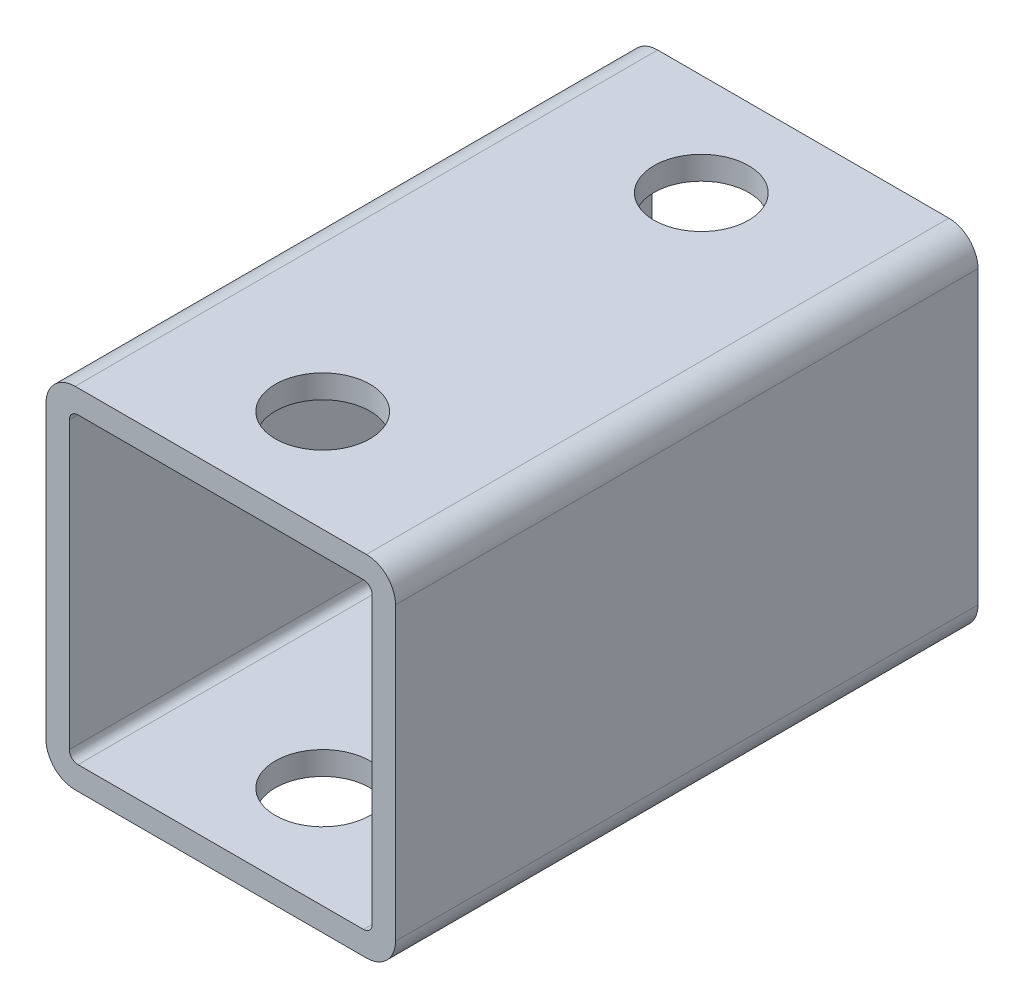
ISO-10303-21;
HEADER;
FILE_DESCRIPTION(('STEP AP214'),'2;1');
FILE_NAME('part.step','',(''),(''),'','','');
FILE_SCHEMA(('AUTOMOTIVE_DESIGN { 1 0 10303 214 1 1 1 1 }'));
ENDSEC;
DATA;
#1=APPLICATION_CONTEXT('core data for automotive mechanical design processes');
#2=APPLICATION_PROTOCOL_DEFINITION('international standard','automotive_design',2000,#1);
#3=PRODUCT_CONTEXT('',#1,'mechanical');
#4=PRODUCT('Part','Part','',(#3));
#5=PRODUCT_RELATED_PRODUCT_CATEGORY('part','',(#4));
#6=PRODUCT_DEFINITION_FORMATION('','',#4);
#7=PRODUCT_DEFINITION_CONTEXT('part definition',#1,'design');
#8=PRODUCT_DEFINITION('design','',#6,#7);
#9=PRODUCT_DEFINITION_SHAPE('','',#8);
#10=(LENGTH_UNIT() NAMED_UNIT(*) SI_UNIT(.MILLI.,.METRE.));
#11=(NAMED_UNIT(*) PLANE_ANGLE_UNIT() SI_UNIT($,.RADIAN.));
#12=(NAMED_UNIT(*) SI_UNIT($,.STERADIAN.) SOLID_ANGLE_UNIT());
#13=UNCERTAINTY_MEASURE_WITH_UNIT(LENGTH_MEASURE(1.E-05),#10,'distance_accuracy_value','');
#14=(GEOMETRIC_REPRESENTATION_CONTEXT(3) GLOBAL_UNCERTAINTY_ASSIGNED_CONTEXT((#13)) GLOBAL_UNIT_ASSIGNED_CONTEXT((#10,
#11,#12)) REPRESENTATION_CONTEXT('',''));
#15=CARTESIAN_POINT('',(0.,0.,0.));
#16=DIRECTION('',(0.,0.,1.));
#17=DIRECTION('',(1.,0.,0.));
#18=AXIS2_PLACEMENT_3D('',#15,#16,#17);
#19=CARTESIAN_POINT('',(-12.5,5.,51.));
#20=DIRECTION('',(0.,0.,-1.));
#21=DIRECTION('',(-1.,0.,0.));
#22=AXIS2_PLACEMENT_3D('',#19,#20,#21);
#23=CYLINDRICAL_SURFACE('',#22,0.999999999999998);
#24=CARTESIAN_POINT('',(-12.5,5.,51.));
#25=DIRECTION('',(0.,0.,-1.));
#26=DIRECTION('',(-1.,0.,0.));
#27=AXIS2_PLACEMENT_3D('',#24,#25,#26);
#28=CIRCLE('',#27,0.999999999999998);
#29=CARTESIAN_POINT('',(-13.5,5.,51.));
#30=VERTEX_POINT('',#29);
#31=CARTESIAN_POINT('',(-12.5,6.,51.));
#32=VERTEX_POINT('',#31);
#33=EDGE_CURVE('E95',#30,#32,#28,.T.);
#34=ORIENTED_EDGE('',*,*,#33,.T.);
#35=DIRECTION('',(0.,0.,1.));
#36=VECTOR('',#35,1.);
#37=CARTESIAN_POINT('',(-12.5,6.,41.));
#38=LINE('',#37,#36);
#39=CARTESIAN_POINT('',(-12.5,6.,31.));
#40=VERTEX_POINT('',#39);
#41=EDGE_CURVE('E92',#32,#40,#38,.F.);
#42=ORIENTED_EDGE('',*,*,#41,.T.);
#43=CARTESIAN_POINT('',(-12.5,5.,31.));
#44=DIRECTION('',(0.,0.,-1.));
#45=DIRECTION('',(-1.,0.,0.));
#46=AXIS2_PLACEMENT_3D('',#43,#44,#45);
#47=CIRCLE('',#46,0.999999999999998);
#48=CARTESIAN_POINT('',(-13.5,5.,31.));
#49=VERTEX_POINT('',#48);
#50=EDGE_CURVE('E21',#49,#40,#47,.T.);
#51=ORIENTED_EDGE('',*,*,#50,.F.);
#52=DIRECTION('',(0.,0.,-1.));
#53=VECTOR('',#52,1.);
#54=CARTESIAN_POINT('',(-13.5,5.,41.));
#55=LINE('',#54,#53);
#56=EDGE_CURVE('E159',#49,#30,#55,.F.);
#57=ORIENTED_EDGE('',*,*,#56,.T.);
#58=EDGE_LOOP('',(#34,#42,#51,#57));
#59=FACE_BOUND('',#58,.T.);
#60=ADVANCED_FACE('F17',(#59),#23,.T.);
#61=CARTESIAN_POINT('',(-12.5,-5.,51.));
#62=DIRECTION('',(0.,0.,-1.));
#63=DIRECTION('',(-1.,0.,0.));
#64=AXIS2_PLACEMENT_3D('',#61,#62,#63);
#65=CYLINDRICAL_SURFACE('',#64,1.);
#66=CARTESIAN_POINT('',(-12.5,-5.,51.));
#67=DIRECTION('',(0.,0.,-1.));
#68=DIRECTION('',(-1.,0.,0.));
#69=AXIS2_PLACEMENT_3D('',#66,#67,#68);
#70=CIRCLE('',#69,1.);
#71=CARTESIAN_POINT('',(-12.5,-6.,51.));
#72=VERTEX_POINT('',#71);
#73=CARTESIAN_POINT('',(-13.5,-5.,51.));
#74=VERTEX_POINT('',#73);
#75=EDGE_CURVE('E210',#72,#74,#70,.T.);
#76=ORIENTED_EDGE('',*,*,#75,.T.);
#77=DIRECTION('',(0.,0.,1.));
#78=VECTOR('',#77,1.);
#79=CARTESIAN_POINT('',(-13.5,-5.,41.));
#80=LINE('',#79,#78);
#81=CARTESIAN_POINT('',(-13.5,-5.,31.));
#82=VERTEX_POINT('',#81);
#83=EDGE_CURVE('E158',#74,#82,#80,.F.);
#84=ORIENTED_EDGE('',*,*,#83,.T.);
#85=CARTESIAN_POINT('',(-12.5,-5.,31.));
#86=DIRECTION('',(0.,0.,-1.));
#87=DIRECTION('',(-1.,0.,0.));
#88=AXIS2_PLACEMENT_3D('',#85,#86,#87);
#89=CIRCLE('',#88,1.);
#90=CARTESIAN_POINT('',(-12.5,-6.,31.));
#91=VERTEX_POINT('',#90);
#92=EDGE_CURVE('E89',#91,#82,#89,.T.);
#93=ORIENTED_EDGE('',*,*,#92,.F.);
#94=DIRECTION('',(0.,0.,-1.));
#95=VECTOR('',#94,1.);
#96=CARTESIAN_POINT('',(-12.5,-6.,41.));
#97=LINE('',#96,#95);
#98=EDGE_CURVE('E151',#91,#72,#97,.F.);
#99=ORIENTED_EDGE('',*,*,#98,.T.);
#100=EDGE_LOOP('',(#76,#84,#93,#99));
#101=FACE_BOUND('',#100,.T.);
#102=ADVANCED_FACE('F235',(#101),#65,.T.);
#103=CARTESIAN_POINT('',(-2.5,5.,51.));
#104=DIRECTION('',(0.,0.,-1.));
#105=DIRECTION('',(-1.,0.,0.));
#106=AXIS2_PLACEMENT_3D('',#103,#104,#105);
#107=CYLINDRICAL_SURFACE('',#106,1.);
#108=CARTESIAN_POINT('',(-2.5,5.,51.));
#109=DIRECTION('',(0.,0.,-1.));
#110=DIRECTION('',(-1.,0.,0.));
#111=AXIS2_PLACEMENT_3D('',#108,#109,#110);
#112=CIRCLE('',#111,1.);
#113=CARTESIAN_POINT('',(-2.5,6.,51.));
#114=VERTEX_POINT('',#113);
#115=CARTESIAN_POINT('',(-1.5,5.,51.));
#116=VERTEX_POINT('',#115);
#117=EDGE_CURVE('E216',#114,#116,#112,.T.);
#118=ORIENTED_EDGE('',*,*,#117,.T.);
#119=DIRECTION('',(0.,0.,1.));
#120=VECTOR('',#119,1.);
#121=CARTESIAN_POINT('',(-1.5,5.,41.));
#122=LINE('',#121,#120);
#123=CARTESIAN_POINT('',(-1.5,5.,31.));
#124=VERTEX_POINT('',#123);
#125=EDGE_CURVE('E147',#116,#124,#122,.F.);
#126=ORIENTED_EDGE('',*,*,#125,.T.);
#127=CARTESIAN_POINT('',(-2.5,5.,31.));
#128=DIRECTION('',(0.,0.,-1.));
#129=DIRECTION('',(-1.,0.,0.));
#130=AXIS2_PLACEMENT_3D('',#127,#128,#129);
#131=CIRCLE('',#130,1.);
#132=CARTESIAN_POINT('',(-2.5,6.,31.));
#133=VERTEX_POINT('',#132);
#134=EDGE_CURVE('E229',#133,#124,#131,.T.);
#135=ORIENTED_EDGE('',*,*,#134,.F.);
#136=DIRECTION('',(0.,0.,-1.));
#137=VECTOR('',#136,1.);
#138=CARTESIAN_POINT('',(-2.5,6.,41.));
#139=LINE('',#138,#137);
#140=EDGE_CURVE('E105',#133,#114,#139,.F.);
#141=ORIENTED_EDGE('',*,*,#140,.T.);
#142=EDGE_LOOP('',(#118,#126,#135,#141));
#143=FACE_BOUND('',#142,.T.);
#144=ADVANCED_FACE('F297',(#143),#107,.T.);
#145=CARTESIAN_POINT('',(-2.5,-5.,51.));
#146=DIRECTION('',(0.,0.,-1.));
#147=DIRECTION('',(-1.,0.,0.));
#148=AXIS2_PLACEMENT_3D('',#145,#146,#147);
#149=CYLINDRICAL_SURFACE('',#148,1.);
#150=CARTESIAN_POINT('',(-2.5,-5.,51.));
#151=DIRECTION('',(0.,0.,-1.));
#152=DIRECTION('',(-1.,0.,0.));
#153=AXIS2_PLACEMENT_3D('',#150,#151,#152);
#154=CIRCLE('',#153,1.);
#155=CARTESIAN_POINT('',(-1.5,-5.,51.));
#156=VERTEX_POINT('',#155);
#157=CARTESIAN_POINT('',(-2.5,-6.,51.));
#158=VERTEX_POINT('',#157);
#159=EDGE_CURVE('E213',#156,#158,#154,.T.);
#160=ORIENTED_EDGE('',*,*,#159,.T.);
#161=DIRECTION('',(0.,0.,1.));
#162=VECTOR('',#161,1.);
#163=CARTESIAN_POINT('',(-2.5,-6.,41.));
#164=LINE('',#163,#162);
#165=CARTESIAN_POINT('',(-2.5,-6.,31.));
#166=VERTEX_POINT('',#165);
#167=EDGE_CURVE('E155',#158,#166,#164,.F.);
#168=ORIENTED_EDGE('',*,*,#167,.T.);
#169=CARTESIAN_POINT('',(-2.5,-5.,31.));
#170=DIRECTION('',(0.,0.,-1.));
#171=DIRECTION('',(-1.,0.,0.));
#172=AXIS2_PLACEMENT_3D('',#169,#170,#171);
#173=CIRCLE('',#172,1.);
#174=CARTESIAN_POINT('',(-1.5,-5.,31.));
#175=VERTEX_POINT('',#174);
#176=EDGE_CURVE('E227',#175,#166,#173,.T.);
#177=ORIENTED_EDGE('',*,*,#176,.F.);
#178=DIRECTION('',(0.,0.,-1.));
#179=VECTOR('',#178,1.);
#180=CARTESIAN_POINT('',(-1.5,-5.,41.));
#181=LINE('',#180,#179);
#182=EDGE_CURVE('E144',#175,#156,#181,.F.);
#183=ORIENTED_EDGE('',*,*,#182,.T.);
#184=EDGE_LOOP('',(#160,#168,#177,#183));
#185=FACE_BOUND('',#184,.T.);
#186=ADVANCED_FACE('F295',(#185),#149,.T.);
#187=CARTESIAN_POINT('',(-2.6,-4.9,31.));
#188=DIRECTION('',(0.,0.,1.));
#189=DIRECTION('',(1.,0.,0.));
#190=AXIS2_PLACEMENT_3D('',#187,#188,#189);
#191=CYLINDRICAL_SURFACE('',#190,0.3);
#192=DIRECTION('',(0.,0.,1.));
#193=VECTOR('',#192,1.);
#194=CARTESIAN_POINT('',(-2.3,-4.9,41.));
#195=LINE('',#194,#193);
#196=CARTESIAN_POINT('',(-2.3,-4.9,51.));
#197=VERTEX_POINT('',#196);
#198=CARTESIAN_POINT('',(-2.3,-4.9,31.));
#199=VERTEX_POINT('',#198);
#200=EDGE_CURVE('E140',#197,#199,#195,.F.);
#201=ORIENTED_EDGE('',*,*,#200,.T.);
#202=CARTESIAN_POINT('',(-2.6,-4.9,31.));
#203=DIRECTION('',(0.,0.,1.));
#204=DIRECTION('',(1.,0.,0.));
#205=AXIS2_PLACEMENT_3D('',#202,#203,#204);
#206=CIRCLE('',#205,0.3);
#207=CARTESIAN_POINT('',(-2.6,-5.2,31.));
#208=VERTEX_POINT('',#207);
#209=EDGE_CURVE('E225',#208,#199,#206,.T.);
#210=ORIENTED_EDGE('',*,*,#209,.F.);
#211=DIRECTION('',(0.,0.,-1.));
#212=VECTOR('',#211,1.);
#213=CARTESIAN_POINT('',(-2.6,-5.2,41.));
#214=LINE('',#213,#212);
#215=CARTESIAN_POINT('',(-2.59999999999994,-5.2,51.));
#216=VERTEX_POINT('',#215);
#217=EDGE_CURVE('E129',#208,#216,#214,.F.);
#218=ORIENTED_EDGE('',*,*,#217,.T.);
#219=CARTESIAN_POINT('',(-2.59999999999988,-4.9,51.));
#220=DIRECTION('',(0.,0.,1.));
#221=DIRECTION('',(1.,0.,0.));
#222=AXIS2_PLACEMENT_3D('',#219,#220,#221);
#223=CIRCLE('',#222,0.3);
#224=EDGE_CURVE('E206',#216,#197,#223,.T.);
#225=ORIENTED_EDGE('',*,*,#224,.T.);
#226=EDGE_LOOP('',(#201,#210,#218,#225));
#227=FACE_BOUND('',#226,.T.);
#228=ADVANCED_FACE('F305',(#227),#191,.F.);
#229=CARTESIAN_POINT('',(-7.5,-6.,34.5));
#230=DIRECTION('',(0.,1.,0.));
#231=DIRECTION('',(0.,0.,1.));
#232=AXIS2_PLACEMENT_3D('',#229,#230,#231);
#233=CYLINDRICAL_SURFACE('',#232,1.62499999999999);
#234=CARTESIAN_POINT('',(-7.5,-6.,34.5));
#235=DIRECTION('',(0.,1.,0.));
#236=DIRECTION('',(0.,0.,1.));
#237=AXIS2_PLACEMENT_3D('',#234,#235,#236);
#238=CIRCLE('',#237,1.62499999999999);
#239=CARTESIAN_POINT('',(-7.5,-6.,36.125));
#240=VERTEX_POINT('',#239);
#241=EDGE_CURVE('E180',#240,#240,#238,.F.);
#242=ORIENTED_EDGE('',*,*,#241,.T.);
#243=EDGE_LOOP('',(#242));
#244=FACE_BOUND('',#243,.T.);
#245=CARTESIAN_POINT('',(-7.5,-5.2,34.5));
#246=DIRECTION('',(0.,1.,0.));
#247=DIRECTION('',(0.,0.,1.));
#248=AXIS2_PLACEMENT_3D('',#245,#246,#247);
#249=CIRCLE('',#248,1.62499999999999);
#250=CARTESIAN_POINT('',(-7.5,-5.2,36.125));
#251=VERTEX_POINT('',#250);
#252=EDGE_CURVE('E173',#251,#251,#249,.T.);
#253=ORIENTED_EDGE('',*,*,#252,.T.);
#254=EDGE_LOOP('',(#253));
#255=FACE_BOUND('',#254,.T.);
#256=ADVANCED_FACE('F375',(#244,#255),#233,.F.);
#257=CARTESIAN_POINT('',(-7.5,-6.,47.5));
#258=DIRECTION('',(0.,1.,0.));
#259=DIRECTION('',(0.,0.,1.));
#260=AXIS2_PLACEMENT_3D('',#257,#258,#259);
#261=CYLINDRICAL_SURFACE('',#260,1.625);
#262=CARTESIAN_POINT('',(-7.5,-6.,47.5));
#263=DIRECTION('',(0.,1.,0.));
#264=DIRECTION('',(0.,0.,1.));
#265=AXIS2_PLACEMENT_3D('',#262,#263,#264);
#266=CIRCLE('',#265,1.625);
#267=CARTESIAN_POINT('',(-7.5,-6.,49.125));
#268=VERTEX_POINT('',#267);
#269=EDGE_CURVE('E150',#268,#268,#266,.F.);
#270=ORIENTED_EDGE('',*,*,#269,.T.);
#271=EDGE_LOOP('',(#270));
#272=FACE_BOUND('',#271,.T.);
#273=CARTESIAN_POINT('',(-7.5,-5.2,47.5));
#274=DIRECTION('',(0.,1.,0.));
#275=DIRECTION('',(0.,0.,1.));
#276=AXIS2_PLACEMENT_3D('',#273,#274,#275);
#277=CIRCLE('',#276,1.625);
#278=CARTESIAN_POINT('',(-7.5,-5.2,49.125));
#279=VERTEX_POINT('',#278);
#280=EDGE_CURVE('E126',#279,#279,#277,.T.);
#281=ORIENTED_EDGE('',*,*,#280,.T.);
#282=EDGE_LOOP('',(#281));
#283=FACE_BOUND('',#282,.T.);
#284=ADVANCED_FACE('F385',(#272,#283),#261,.F.);
#285=CARTESIAN_POINT('',(-12.4,-4.9,31.));
#286=DIRECTION('',(0.,0.,1.));
#287=DIRECTION('',(0.,-1.,0.));
#288=AXIS2_PLACEMENT_3D('',#285,#286,#287);
#289=CYLINDRICAL_SURFACE('',#288,0.299999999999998);
#290=DIRECTION('',(0.,0.,1.));
#291=VECTOR('',#290,1.);
#292=CARTESIAN_POINT('',(-12.4,-5.2,41.));
#293=LINE('',#292,#291);
#294=CARTESIAN_POINT('',(-12.4,-5.2,51.));
#295=VERTEX_POINT('',#294);
#296=CARTESIAN_POINT('',(-12.4,-5.2,31.));
#297=VERTEX_POINT('',#296);
#298=EDGE_CURVE('E133',#295,#297,#293,.F.);
#299=ORIENTED_EDGE('',*,*,#298,.T.);
#300=CARTESIAN_POINT('',(-12.4,-4.9,31.));
#301=DIRECTION('',(0.,0.,1.));
#302=DIRECTION('',(0.,-1.,0.));
#303=AXIS2_PLACEMENT_3D('',#300,#301,#302);
#304=CIRCLE('',#303,0.299999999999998);
#305=CARTESIAN_POINT('',(-12.7,-4.9,31.));
#306=VERTEX_POINT('',#305);
#307=EDGE_CURVE('E223',#306,#297,#304,.T.);
#308=ORIENTED_EDGE('',*,*,#307,.F.);
#309=DIRECTION('',(0.,0.,-1.));
#310=VECTOR('',#309,1.);
#311=CARTESIAN_POINT('',(-12.7,-4.9,41.));
#312=LINE('',#311,#310);
#313=CARTESIAN_POINT('',(-12.7,-4.90000000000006,51.));
#314=VERTEX_POINT('',#313);
#315=EDGE_CURVE('E122',#306,#314,#312,.F.);
#316=ORIENTED_EDGE('',*,*,#315,.T.);
#317=CARTESIAN_POINT('',(-12.4,-4.90000000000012,51.));
#318=DIRECTION('',(0.,0.,1.));
#319=DIRECTION('',(0.,-1.,0.));
#320=AXIS2_PLACEMENT_3D('',#317,#318,#319);
#321=CIRCLE('',#320,0.299999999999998);
#322=EDGE_CURVE('E165',#314,#295,#321,.T.);
#323=ORIENTED_EDGE('',*,*,#322,.T.);
#324=EDGE_LOOP('',(#299,#308,#316,#323));
#325=FACE_BOUND('',#324,.T.);
#326=ADVANCED_FACE('F395',(#325),#289,.F.);
#327=CARTESIAN_POINT('',(-2.6,4.9,31.));
#328=DIRECTION('',(0.,0.,1.));
#329=DIRECTION('',(0.,-1.,0.));
#330=AXIS2_PLACEMENT_3D('',#327,#328,#329);
#331=CYLINDRICAL_SURFACE('',#330,0.3);
#332=DIRECTION('',(0.,0.,1.));
#333=VECTOR('',#332,1.);
#334=CARTESIAN_POINT('',(-2.6,5.2,41.));
#335=LINE('',#334,#333);
#336=CARTESIAN_POINT('',(-2.6,5.2,51.));
#337=VERTEX_POINT('',#336);
#338=CARTESIAN_POINT('',(-2.6,5.2,31.));
#339=VERTEX_POINT('',#338);
#340=EDGE_CURVE('E119',#337,#339,#335,.F.);
#341=ORIENTED_EDGE('',*,*,#340,.T.);
#342=CARTESIAN_POINT('',(-2.6,4.9,31.));
#343=DIRECTION('',(0.,0.,1.));
#344=DIRECTION('',(0.,-1.,0.));
#345=AXIS2_PLACEMENT_3D('',#342,#343,#344);
#346=CIRCLE('',#345,0.3);
#347=CARTESIAN_POINT('',(-2.3,4.9,31.));
#348=VERTEX_POINT('',#347);
#349=EDGE_CURVE('E36',#348,#339,#346,.T.);
#350=ORIENTED_EDGE('',*,*,#349,.F.);
#351=DIRECTION('',(0.,0.,-1.));
#352=VECTOR('',#351,1.);
#353=CARTESIAN_POINT('',(-2.3,4.9,41.));
#354=LINE('',#353,#352);
#355=CARTESIAN_POINT('',(-2.3,4.90000000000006,51.));
#356=VERTEX_POINT('',#355);
#357=EDGE_CURVE('E137',#348,#356,#354,.F.);
#358=ORIENTED_EDGE('',*,*,#357,.T.);
#359=CARTESIAN_POINT('',(-2.6,4.90000000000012,51.));
#360=DIRECTION('',(0.,0.,1.));
#361=DIRECTION('',(0.,-1.,0.));
#362=AXIS2_PLACEMENT_3D('',#359,#360,#361);
#363=CIRCLE('',#362,0.3);
#364=EDGE_CURVE('E203',#356,#337,#363,.T.);
#365=ORIENTED_EDGE('',*,*,#364,.T.);
#366=EDGE_LOOP('',(#341,#350,#358,#365));
#367=FACE_BOUND('',#366,.T.);
#368=ADVANCED_FACE('F405',(#367),#331,.F.);
#369=CARTESIAN_POINT('',(-12.4,4.9,31.));
#370=DIRECTION('',(0.,0.,1.));
#371=DIRECTION('',(1.,0.,0.));
#372=AXIS2_PLACEMENT_3D('',#369,#370,#371);
#373=CYLINDRICAL_SURFACE('',#372,0.3);
#374=DIRECTION('',(0.,0.,1.));
#375=VECTOR('',#374,1.);
#376=CARTESIAN_POINT('',(-12.7,4.9,41.));
#377=LINE('',#376,#375);
#378=CARTESIAN_POINT('',(-12.7,4.9,51.));
#379=VERTEX_POINT('',#378);
#380=CARTESIAN_POINT('',(-12.7,4.9,31.));
#381=VERTEX_POINT('',#380);
#382=EDGE_CURVE('E121',#379,#381,#377,.F.);
#383=ORIENTED_EDGE('',*,*,#382,.T.);
#384=CARTESIAN_POINT('',(-12.4,4.9,31.));
#385=DIRECTION('',(0.,0.,1.));
#386=DIRECTION('',(1.,0.,0.));
#387=AXIS2_PLACEMENT_3D('',#384,#385,#386);
#388=CIRCLE('',#387,0.3);
#389=CARTESIAN_POINT('',(-12.4,5.2,31.));
#390=VERTEX_POINT('',#389);
#391=EDGE_CURVE('E219',#390,#381,#388,.T.);
#392=ORIENTED_EDGE('',*,*,#391,.F.);
#393=DIRECTION('',(0.,0.,-1.));
#394=VECTOR('',#393,1.);
#395=CARTESIAN_POINT('',(-12.4,5.2,41.));
#396=LINE('',#395,#394);
#397=CARTESIAN_POINT('',(-12.4000000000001,5.2,51.));
#398=VERTEX_POINT('',#397);
#399=EDGE_CURVE('E115',#390,#398,#396,.F.);
#400=ORIENTED_EDGE('',*,*,#399,.T.);
#401=CARTESIAN_POINT('',(-12.4000000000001,4.9,51.));
#402=DIRECTION('',(0.,0.,1.));
#403=DIRECTION('',(1.,0.,0.));
#404=AXIS2_PLACEMENT_3D('',#401,#402,#403);
#405=CIRCLE('',#404,0.3);
#406=EDGE_CURVE('E200',#398,#379,#405,.T.);
#407=ORIENTED_EDGE('',*,*,#406,.T.);
#408=EDGE_LOOP('',(#383,#392,#400,#407));
#409=FACE_BOUND('',#408,.T.);
#410=ADVANCED_FACE('F268',(#409),#373,.F.);
#411=CARTESIAN_POINT('',(-13.74,6.24,51.));
#412=DIRECTION('',(0.,0.,1.));
#413=DIRECTION('',(0.,-1.,0.));
#414=AXIS2_PLACEMENT_3D('',#411,#412,#413);
#415=PLANE('',#414);
#416=DIRECTION('',(0.,-1.,0.));
#417=VECTOR('',#416,1.);
#418=CARTESIAN_POINT('',(-12.7,0.,51.));
#419=LINE('',#418,#417);
#420=EDGE_CURVE('E125',#314,#379,#419,.F.);
#421=ORIENTED_EDGE('',*,*,#420,.T.);
#422=ORIENTED_EDGE('',*,*,#406,.F.);
#423=DIRECTION('',(-1.,0.,0.));
#424=VECTOR('',#423,1.);
#425=CARTESIAN_POINT('',(-7.5,5.2,51.));
#426=LINE('',#425,#424);
#427=EDGE_CURVE('E118',#398,#337,#426,.F.);
#428=ORIENTED_EDGE('',*,*,#427,.T.);
#429=ORIENTED_EDGE('',*,*,#364,.F.);
#430=DIRECTION('',(0.,1.,0.));
#431=VECTOR('',#430,1.);
#432=CARTESIAN_POINT('',(-2.3,0.,51.));
#433=LINE('',#432,#431);
#434=EDGE_CURVE('E136',#356,#197,#433,.F.);
#435=ORIENTED_EDGE('',*,*,#434,.T.);
#436=ORIENTED_EDGE('',*,*,#224,.F.);
#437=DIRECTION('',(1.,0.,0.));
#438=VECTOR('',#437,1.);
#439=CARTESIAN_POINT('',(-7.5,-5.2,51.));
#440=LINE('',#439,#438);
#441=EDGE_CURVE('E132',#216,#295,#440,.F.);
#442=ORIENTED_EDGE('',*,*,#441,.T.);
#443=ORIENTED_EDGE('',*,*,#322,.F.);
#444=EDGE_LOOP('',(#421,#422,#428,#429,#435,#436,#442,#443));
#445=FACE_BOUND('',#444,.T.);
#446=ORIENTED_EDGE('',*,*,#33,.F.);
#447=DIRECTION('',(0.,1.,0.));
#448=VECTOR('',#447,1.);
#449=CARTESIAN_POINT('',(-13.5,0.,51.));
#450=LINE('',#449,#448);
#451=EDGE_CURVE('E161',#30,#74,#450,.F.);
#452=ORIENTED_EDGE('',*,*,#451,.T.);
#453=ORIENTED_EDGE('',*,*,#75,.F.);
#454=DIRECTION('',(-1.,0.,0.));
#455=VECTOR('',#454,1.);
#456=CARTESIAN_POINT('',(-7.5,-6.,51.));
#457=LINE('',#456,#455);
#458=EDGE_CURVE('E154',#72,#158,#457,.F.);
#459=ORIENTED_EDGE('',*,*,#458,.T.);
#460=ORIENTED_EDGE('',*,*,#159,.F.);
#461=DIRECTION('',(0.,-1.,0.));
#462=VECTOR('',#461,1.);
#463=CARTESIAN_POINT('',(-1.5,0.,51.));
#464=LINE('',#463,#462);
#465=EDGE_CURVE('E143',#156,#116,#464,.F.);
#466=ORIENTED_EDGE('',*,*,#465,.T.);
#467=ORIENTED_EDGE('',*,*,#117,.F.);
#468=DIRECTION('',(1.,0.,0.));
#469=VECTOR('',#468,1.);
#470=CARTESIAN_POINT('',(-7.5,6.,51.));
#471=LINE('',#470,#469);
#472=EDGE_CURVE('E100',#114,#32,#471,.F.);
#473=ORIENTED_EDGE('',*,*,#472,.T.);
#474=EDGE_LOOP('',(#446,#452,#453,#459,#460,#466,#467,#473));
#475=FACE_BOUND('',#474,.T.);
#476=ADVANCED_FACE('F288',(#445,#475),#415,.T.);
#477=CARTESIAN_POINT('',(-7.5,5.2,34.5));
#478=DIRECTION('',(0.,1.,0.));
#479=DIRECTION('',(0.,0.,1.));
#480=AXIS2_PLACEMENT_3D('',#477,#478,#479);
#481=CYLINDRICAL_SURFACE('',#480,1.62499999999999);
#482=CARTESIAN_POINT('',(-7.5,6.,34.5));
#483=DIRECTION('',(0.,1.,0.));
#484=DIRECTION('',(0.,0.,1.));
#485=AXIS2_PLACEMENT_3D('',#482,#483,#484);
#486=CIRCLE('',#485,1.62499999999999);
#487=CARTESIAN_POINT('',(-7.5,6.,36.125));
#488=VERTEX_POINT('',#487);
#489=EDGE_CURVE('E99',#488,#488,#486,.T.);
#490=ORIENTED_EDGE('',*,*,#489,.T.);
#491=EDGE_LOOP('',(#490));
#492=FACE_BOUND('',#491,.T.);
#493=CARTESIAN_POINT('',(-7.5,5.2,34.5));
#494=DIRECTION('',(0.,1.,0.));
#495=DIRECTION('',(0.,0.,1.));
#496=AXIS2_PLACEMENT_3D('',#493,#494,#495);
#497=CIRCLE('',#496,1.62499999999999);
#498=CARTESIAN_POINT('',(-7.5,5.2,36.125));
#499=VERTEX_POINT('',#498);
#500=EDGE_CURVE('E111',#499,#499,#497,.F.);
#501=ORIENTED_EDGE('',*,*,#500,.T.);
#502=EDGE_LOOP('',(#501));
#503=FACE_BOUND('',#502,.T.);
#504=ADVANCED_FACE('F342',(#492,#503),#481,.F.);
#505=CARTESIAN_POINT('',(-7.5,5.2,47.5));
#506=DIRECTION('',(0.,1.,0.));
#507=DIRECTION('',(0.,0.,1.));
#508=AXIS2_PLACEMENT_3D('',#505,#506,#507);
#509=CYLINDRICAL_SURFACE('',#508,1.625);
#510=CARTESIAN_POINT('',(-7.5,6.,47.5));
#511=DIRECTION('',(0.,1.,0.));
#512=DIRECTION('',(0.,0.,1.));
#513=AXIS2_PLACEMENT_3D('',#510,#511,#512);
#514=CIRCLE('',#513,1.625);
#515=CARTESIAN_POINT('',(-7.5,6.,49.125));
#516=VERTEX_POINT('',#515);
#517=EDGE_CURVE('E162',#516,#516,#514,.T.);
#518=ORIENTED_EDGE('',*,*,#517,.T.);
#519=EDGE_LOOP('',(#518));
#520=FACE_BOUND('',#519,.T.);
#521=CARTESIAN_POINT('',(-7.5,5.2,47.5));
#522=DIRECTION('',(0.,1.,0.));
#523=DIRECTION('',(0.,0.,1.));
#524=AXIS2_PLACEMENT_3D('',#521,#522,#523);
#525=CIRCLE('',#524,1.625);
#526=CARTESIAN_POINT('',(-7.5,5.2,49.125));
#527=VERTEX_POINT('',#526);
#528=EDGE_CURVE('E106',#527,#527,#525,.F.);
#529=ORIENTED_EDGE('',*,*,#528,.T.);
#530=EDGE_LOOP('',(#529));
#531=FACE_BOUND('',#530,.T.);
#532=ADVANCED_FACE('F338',(#520,#531),#509,.F.);
#533=CARTESIAN_POINT('',(-2.3,6.,30.6));
#534=DIRECTION('',(0.,1.,0.));
#535=DIRECTION('',(-1.,0.,0.));
#536=AXIS2_PLACEMENT_3D('',#533,#534,#535);
#537=PLANE('',#536);
#538=ORIENTED_EDGE('',*,*,#517,.F.);
#539=EDGE_LOOP('',(#538));
#540=FACE_BOUND('',#539,.T.);
#541=ORIENTED_EDGE('',*,*,#489,.F.);
#542=EDGE_LOOP('',(#541));
#543=FACE_BOUND('',#542,.T.);
#544=ORIENTED_EDGE('',*,*,#41,.F.);
#545=ORIENTED_EDGE('',*,*,#472,.F.);
#546=ORIENTED_EDGE('',*,*,#140,.F.);
#547=DIRECTION('',(-1.,0.,0.));
#548=VECTOR('',#547,1.);
#549=CARTESIAN_POINT('',(-7.5,6.,31.));
#550=LINE('',#549,#548);
#551=EDGE_CURVE('E86',#133,#40,#550,.T.);
#552=ORIENTED_EDGE('',*,*,#551,.T.);
#553=EDGE_LOOP('',(#544,#545,#546,#552));
#554=FACE_BOUND('',#553,.T.);
#555=ADVANCED_FACE('F103',(#540,#543,#554),#537,.T.);
#556=CARTESIAN_POINT('',(-13.5,5.2,30.6));
#557=DIRECTION('',(-1.,0.,0.));
#558=DIRECTION('',(0.,-1.,0.));
#559=AXIS2_PLACEMENT_3D('',#556,#557,#558);
#560=PLANE('',#559);
#561=ORIENTED_EDGE('',*,*,#83,.F.);
#562=ORIENTED_EDGE('',*,*,#451,.F.);
#563=ORIENTED_EDGE('',*,*,#56,.F.);
#564=DIRECTION('',(0.,-1.,0.));
#565=VECTOR('',#564,1.);
#566=CARTESIAN_POINT('',(-13.5,0.,31.));
#567=LINE('',#566,#565);
#568=EDGE_CURVE('E88',#49,#82,#567,.T.);
#569=ORIENTED_EDGE('',*,*,#568,.T.);
#570=EDGE_LOOP('',(#561,#562,#563,#569));
#571=FACE_BOUND('',#570,.T.);
#572=ADVANCED_FACE('F240',(#571),#560,.T.);
#573=CARTESIAN_POINT('',(-12.7,-6.,30.6));
#574=DIRECTION('',(0.,-1.,0.));
#575=DIRECTION('',(1.,0.,0.));
#576=AXIS2_PLACEMENT_3D('',#573,#574,#575);
#577=PLANE('',#576);
#578=ORIENTED_EDGE('',*,*,#269,.F.);
#579=EDGE_LOOP('',(#578));
#580=FACE_BOUND('',#579,.T.);
#581=ORIENTED_EDGE('',*,*,#241,.F.);
#582=EDGE_LOOP('',(#581));
#583=FACE_BOUND('',#582,.T.);
#584=ORIENTED_EDGE('',*,*,#98,.F.);
#585=DIRECTION('',(1.,0.,0.));
#586=VECTOR('',#585,1.);
#587=CARTESIAN_POINT('',(-7.5,-6.,31.));
#588=LINE('',#587,#586);
#589=EDGE_CURVE('E108',#91,#166,#588,.T.);
#590=ORIENTED_EDGE('',*,*,#589,.T.);
#591=ORIENTED_EDGE('',*,*,#167,.F.);
#592=ORIENTED_EDGE('',*,*,#458,.F.);
#593=EDGE_LOOP('',(#584,#590,#591,#592));
#594=FACE_BOUND('',#593,.T.);
#595=ADVANCED_FACE('F286',(#580,#583,#594),#577,.T.);
#596=CARTESIAN_POINT('',(-1.5,-5.2,30.6));
#597=DIRECTION('',(1.,0.,0.));
#598=DIRECTION('',(0.,1.,0.));
#599=AXIS2_PLACEMENT_3D('',#596,#597,#598);
#600=PLANE('',#599);
#601=ORIENTED_EDGE('',*,*,#182,.F.);
#602=DIRECTION('',(0.,1.,0.));
#603=VECTOR('',#602,1.);
#604=CARTESIAN_POINT('',(-1.5,0.,31.));
#605=LINE('',#604,#603);
#606=EDGE_CURVE('E283',#175,#124,#605,.T.);
#607=ORIENTED_EDGE('',*,*,#606,.T.);
#608=ORIENTED_EDGE('',*,*,#125,.F.);
#609=ORIENTED_EDGE('',*,*,#465,.F.);
#610=EDGE_LOOP('',(#601,#607,#608,#609));
#611=FACE_BOUND('',#610,.T.);
#612=ADVANCED_FACE('F293',(#611),#600,.T.);
#613=CARTESIAN_POINT('',(-2.3,5.096,30.6));
#614=DIRECTION('',(-1.,0.,0.));
#615=DIRECTION('',(0.,-1.,0.));
#616=AXIS2_PLACEMENT_3D('',#613,#614,#615);
#617=PLANE('',#616);
#618=ORIENTED_EDGE('',*,*,#357,.F.);
#619=DIRECTION('',(0.,-1.,0.));
#620=VECTOR('',#619,1.);
#621=CARTESIAN_POINT('',(-2.3,0.,31.));
#622=LINE('',#621,#620);
#623=EDGE_CURVE('E278',#348,#199,#622,.T.);
#624=ORIENTED_EDGE('',*,*,#623,.T.);
#625=ORIENTED_EDGE('',*,*,#200,.F.);
#626=ORIENTED_EDGE('',*,*,#434,.F.);
#627=EDGE_LOOP('',(#618,#624,#625,#626));
#628=FACE_BOUND('',#627,.T.);
#629=ADVANCED_FACE('F324',(#628),#617,.T.);
#630=CARTESIAN_POINT('',(-2.404,-5.2,30.6));
#631=DIRECTION('',(0.,1.,0.));
#632=DIRECTION('',(-1.,0.,0.));
#633=AXIS2_PLACEMENT_3D('',#630,#631,#632);
#634=PLANE('',#633);
#635=ORIENTED_EDGE('',*,*,#280,.F.);
#636=EDGE_LOOP('',(#635));
#637=FACE_BOUND('',#636,.T.);
#638=ORIENTED_EDGE('',*,*,#252,.F.);
#639=EDGE_LOOP('',(#638));
#640=FACE_BOUND('',#639,.T.);
#641=ORIENTED_EDGE('',*,*,#217,.F.);
#642=DIRECTION('',(-1.,0.,0.));
#643=VECTOR('',#642,1.);
#644=CARTESIAN_POINT('',(-7.5,-5.2,31.));
#645=LINE('',#644,#643);
#646=EDGE_CURVE('E275',#208,#297,#645,.T.);
#647=ORIENTED_EDGE('',*,*,#646,.T.);
#648=ORIENTED_EDGE('',*,*,#298,.F.);
#649=ORIENTED_EDGE('',*,*,#441,.F.);
#650=EDGE_LOOP('',(#641,#647,#648,#649));
#651=FACE_BOUND('',#650,.T.);
#652=ADVANCED_FACE('F317',(#637,#640,#651),#634,.T.);
#653=CARTESIAN_POINT('',(-12.7,-5.096,30.6));
#654=DIRECTION('',(1.,0.,0.));
#655=DIRECTION('',(0.,1.,0.));
#656=AXIS2_PLACEMENT_3D('',#653,#654,#655);
#657=PLANE('',#656);
#658=ORIENTED_EDGE('',*,*,#382,.F.);
#659=ORIENTED_EDGE('',*,*,#420,.F.);
#660=ORIENTED_EDGE('',*,*,#315,.F.);
#661=DIRECTION('',(0.,1.,0.));
#662=VECTOR('',#661,1.);
#663=CARTESIAN_POINT('',(-12.7,0.,31.));
#664=LINE('',#663,#662);
#665=EDGE_CURVE('E27',#306,#381,#664,.T.);
#666=ORIENTED_EDGE('',*,*,#665,.T.);
#667=EDGE_LOOP('',(#658,#659,#660,#666));
#668=FACE_BOUND('',#667,.T.);
#669=ADVANCED_FACE('F274',(#668),#657,.T.);
#670=CARTESIAN_POINT('',(-12.596,5.2,30.6));
#671=DIRECTION('',(0.,-1.,0.));
#672=DIRECTION('',(1.,0.,0.));
#673=AXIS2_PLACEMENT_3D('',#670,#671,#672);
#674=PLANE('',#673);
#675=ORIENTED_EDGE('',*,*,#528,.F.);
#676=EDGE_LOOP('',(#675));
#677=FACE_BOUND('',#676,.T.);
#678=ORIENTED_EDGE('',*,*,#500,.F.);
#679=EDGE_LOOP('',(#678));
#680=FACE_BOUND('',#679,.T.);
#681=ORIENTED_EDGE('',*,*,#399,.F.);
#682=DIRECTION('',(1.,0.,0.));
#683=VECTOR('',#682,1.);
#684=CARTESIAN_POINT('',(-7.5,5.2,31.));
#685=LINE('',#684,#683);
#686=EDGE_CURVE('E11',#390,#339,#685,.T.);
#687=ORIENTED_EDGE('',*,*,#686,.T.);
#688=ORIENTED_EDGE('',*,*,#340,.F.);
#689=ORIENTED_EDGE('',*,*,#427,.F.);
#690=EDGE_LOOP('',(#681,#687,#688,#689));
#691=FACE_BOUND('',#690,.T.);
#692=ADVANCED_FACE('F309',(#677,#680,#691),#674,.T.);
#693=CARTESIAN_POINT('',(-13.74,6.24,31.));
#694=DIRECTION('',(0.,0.,1.));
#695=DIRECTION('',(0.,-1.,0.));
#696=AXIS2_PLACEMENT_3D('',#693,#694,#695);
#697=PLANE('',#696);
#698=ORIENTED_EDGE('',*,*,#686,.F.);
#699=ORIENTED_EDGE('',*,*,#391,.T.);
#700=ORIENTED_EDGE('',*,*,#665,.F.);
#701=ORIENTED_EDGE('',*,*,#307,.T.);
#702=ORIENTED_EDGE('',*,*,#646,.F.);
#703=ORIENTED_EDGE('',*,*,#209,.T.);
#704=ORIENTED_EDGE('',*,*,#623,.F.);
#705=ORIENTED_EDGE('',*,*,#349,.T.);
#706=EDGE_LOOP('',(#698,#699,#700,#701,#702,#703,#704,#705));
#707=FACE_BOUND('',#706,.T.);
#708=ORIENTED_EDGE('',*,*,#176,.T.);
#709=ORIENTED_EDGE('',*,*,#589,.F.);
#710=ORIENTED_EDGE('',*,*,#92,.T.);
#711=ORIENTED_EDGE('',*,*,#568,.F.);
#712=ORIENTED_EDGE('',*,*,#50,.T.);
#713=ORIENTED_EDGE('',*,*,#551,.F.);
#714=ORIENTED_EDGE('',*,*,#134,.T.);
#715=ORIENTED_EDGE('',*,*,#606,.F.);
#716=EDGE_LOOP('',(#708,#709,#710,#711,#712,#713,#714,#715));
#717=FACE_BOUND('',#716,.T.);
#718=ADVANCED_FACE('F19',(#707,#717),#697,.F.);
#719=CLOSED_SHELL('',(#60,#102,#144,#186,#228,#256,#284,#326,#368,#410,#476,#504,#532,#555,#572,
#595,#612,#629,#652,#669,#692,#718));
#720=MANIFOLD_SOLID_BREP('B1',#719);
#721=ADVANCED_BREP_SHAPE_REPRESENTATION('',(#18,#720),#14);
#722=SHAPE_DEFINITION_REPRESENTATION(#9,#721);
ENDSEC;
END-ISO-10303-21;
